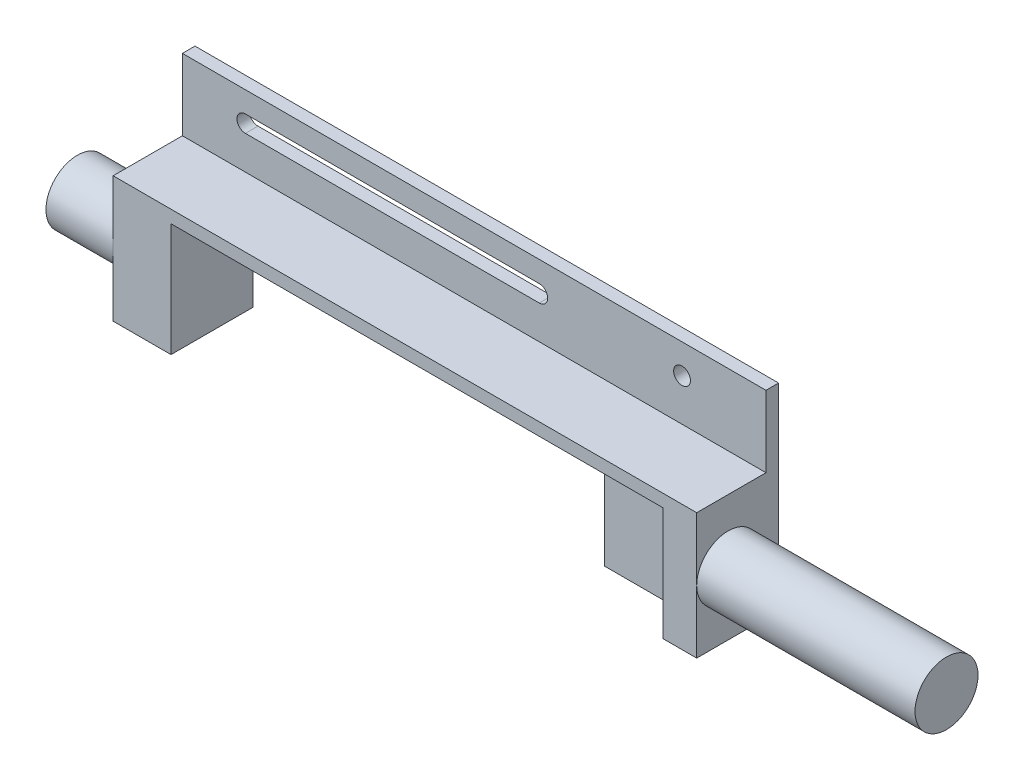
ISO-10303-21;
HEADER;
FILE_DESCRIPTION(('STEP AP214'),'2;1');
FILE_NAME('part.step','',(''),(''),'','','');
FILE_SCHEMA(('AUTOMOTIVE_DESIGN { 1 0 10303 214 1 1 1 1 }'));
ENDSEC;
DATA;
#1=APPLICATION_CONTEXT('core data for automotive mechanical design processes');
#2=APPLICATION_PROTOCOL_DEFINITION('international standard','automotive_design',2000,#1);
#3=PRODUCT_CONTEXT('',#1,'mechanical');
#4=PRODUCT('Part','Part','',(#3));
#5=PRODUCT_RELATED_PRODUCT_CATEGORY('part','',(#4));
#6=PRODUCT_DEFINITION_FORMATION('','',#4);
#7=PRODUCT_DEFINITION_CONTEXT('part definition',#1,'design');
#8=PRODUCT_DEFINITION('design','',#6,#7);
#9=PRODUCT_DEFINITION_SHAPE('','',#8);
#10=(LENGTH_UNIT() NAMED_UNIT(*) SI_UNIT(.MILLI.,.METRE.));
#11=(NAMED_UNIT(*) PLANE_ANGLE_UNIT() SI_UNIT($,.RADIAN.));
#12=(NAMED_UNIT(*) SI_UNIT($,.STERADIAN.) SOLID_ANGLE_UNIT());
#13=UNCERTAINTY_MEASURE_WITH_UNIT(LENGTH_MEASURE(1.E-05),#10,'distance_accuracy_value','');
#14=(GEOMETRIC_REPRESENTATION_CONTEXT(3) GLOBAL_UNCERTAINTY_ASSIGNED_CONTEXT((#13)) GLOBAL_UNIT_ASSIGNED_CONTEXT((#10,
#11,#12)) REPRESENTATION_CONTEXT('',''));
#15=CARTESIAN_POINT('',(0.,0.,0.));
#16=DIRECTION('',(0.,0.,1.));
#17=DIRECTION('',(1.,0.,0.));
#18=AXIS2_PLACEMENT_3D('',#15,#16,#17);
#19=CARTESIAN_POINT('',(109.,0.,-23.45));
#20=DIRECTION('',(1.,0.,0.));
#21=DIRECTION('',(0.,0.,-1.));
#22=AXIS2_PLACEMENT_3D('',#19,#20,#21);
#23=PLANE('',#22);
#24=DIRECTION('',(0.,-1.,0.));
#25=VECTOR('',#24,1.);
#26=CARTESIAN_POINT('',(109.,0.,1.74999999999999));
#27=LINE('',#26,#25);
#28=CARTESIAN_POINT('',(109.,27.,1.74999999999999));
#29=VERTEX_POINT('',#28);
#30=CARTESIAN_POINT('',(109.,0.,1.74999999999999));
#31=VERTEX_POINT('',#30);
#32=EDGE_CURVE('E190',#29,#31,#27,.T.);
#33=ORIENTED_EDGE('',*,*,#32,.F.);
#34=DIRECTION('',(0.,0.,-1.));
#35=VECTOR('',#34,1.);
#36=CARTESIAN_POINT('',(109.,27.,9.75));
#37=LINE('',#36,#35);
#38=CARTESIAN_POINT('',(109.,27.,-9.75));
#39=VERTEX_POINT('',#38);
#40=EDGE_CURVE('E186',#29,#39,#37,.T.);
#41=ORIENTED_EDGE('',*,*,#40,.T.);
#42=DIRECTION('',(0.,-1.,0.));
#43=VECTOR('',#42,1.);
#44=CARTESIAN_POINT('',(109.,0.,-9.75));
#45=LINE('',#44,#43);
#46=CARTESIAN_POINT('',(109.,0.,-9.75));
#47=VERTEX_POINT('',#46);
#48=EDGE_CURVE('E233',#39,#47,#45,.T.);
#49=ORIENTED_EDGE('',*,*,#48,.T.);
#50=DIRECTION('',(0.,0.,-1.));
#51=VECTOR('',#50,1.);
#52=CARTESIAN_POINT('',(109.,0.,9.75));
#53=LINE('',#52,#51);
#54=EDGE_CURVE('E242',#31,#47,#53,.T.);
#55=ORIENTED_EDGE('',*,*,#54,.F.);
#56=EDGE_LOOP('',(#33,#41,#49,#55));
#57=FACE_BOUND('',#56,.T.);
#58=ADVANCED_FACE('F46',(#57),#23,.F.);
#59=CARTESIAN_POINT('',(126.,17.,9.751));
#60=DIRECTION('',(0.,0.,-1.));
#61=DIRECTION('',(-1.,0.,0.));
#62=AXIS2_PLACEMENT_3D('',#59,#60,#61);
#63=CYLINDRICAL_SURFACE('',#62,2.50000000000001);
#64=CARTESIAN_POINT('',(126.,17.,-9.75));
#65=DIRECTION('',(0.,0.,-1.));
#66=DIRECTION('',(-1.,0.,0.));
#67=AXIS2_PLACEMENT_3D('',#64,#65,#66);
#68=CIRCLE('',#67,2.50000000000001);
#69=CARTESIAN_POINT('',(123.5,17.,-9.75));
#70=VERTEX_POINT('',#69);
#71=EDGE_CURVE('E211',#70,#70,#68,.T.);
#72=ORIENTED_EDGE('',*,*,#71,.T.);
#73=EDGE_LOOP('',(#72));
#74=FACE_BOUND('',#73,.T.);
#75=CARTESIAN_POINT('',(126.,17.,1.74999999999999));
#76=DIRECTION('',(0.,0.,1.));
#77=DIRECTION('',(1.,0.,0.));
#78=AXIS2_PLACEMENT_3D('',#75,#76,#77);
#79=CIRCLE('',#78,2.50000000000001);
#80=CARTESIAN_POINT('',(128.5,17.,1.74999999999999));
#81=VERTEX_POINT('',#80);
#82=EDGE_CURVE('E207',#81,#81,#79,.F.);
#83=ORIENTED_EDGE('',*,*,#82,.F.);
#84=EDGE_LOOP('',(#83));
#85=FACE_BOUND('',#84,.T.);
#86=ADVANCED_FACE('F398',(#74,#85),#63,.F.);
#87=CARTESIAN_POINT('',(126.,7.,9.751));
#88=DIRECTION('',(0.,0.,-1.));
#89=DIRECTION('',(-1.,0.,0.));
#90=AXIS2_PLACEMENT_3D('',#87,#88,#89);
#91=CYLINDRICAL_SURFACE('',#90,2.5);
#92=CARTESIAN_POINT('',(126.,7.,-9.75));
#93=DIRECTION('',(0.,0.,-1.));
#94=DIRECTION('',(-1.,0.,0.));
#95=AXIS2_PLACEMENT_3D('',#92,#93,#94);
#96=CIRCLE('',#95,2.5);
#97=CARTESIAN_POINT('',(123.5,7.,-9.75));
#98=VERTEX_POINT('',#97);
#99=EDGE_CURVE('E212',#98,#98,#96,.T.);
#100=ORIENTED_EDGE('',*,*,#99,.T.);
#101=EDGE_LOOP('',(#100));
#102=FACE_BOUND('',#101,.T.);
#103=CARTESIAN_POINT('',(126.,7.,1.74999999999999));
#104=DIRECTION('',(0.,0.,1.));
#105=DIRECTION('',(1.,0.,0.));
#106=AXIS2_PLACEMENT_3D('',#103,#104,#105);
#107=CIRCLE('',#106,2.5);
#108=CARTESIAN_POINT('',(128.5,7.,1.74999999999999));
#109=VERTEX_POINT('',#108);
#110=EDGE_CURVE('E50',#109,#109,#107,.F.);
#111=ORIENTED_EDGE('',*,*,#110,.F.);
#112=EDGE_LOOP('',(#111));
#113=FACE_BOUND('',#112,.T.);
#114=ADVANCED_FACE('F405',(#102,#113),#91,.F.);
#115=CARTESIAN_POINT('',(139.,0.,9.74999999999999));
#116=DIRECTION('',(0.,1.,0.));
#117=DIRECTION('',(0.,0.,1.));
#118=AXIS2_PLACEMENT_3D('',#115,#116,#117);
#119=PLANE('',#118);
#120=DIRECTION('',(-1.,0.,0.));
#121=VECTOR('',#120,1.);
#122=CARTESIAN_POINT('',(139.,0.,9.74999999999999));
#123=LINE('',#122,#121);
#124=CARTESIAN_POINT('',(139.,0.,9.74999999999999));
#125=VERTEX_POINT('',#124);
#126=CARTESIAN_POINT('',(131.,0.,9.74999999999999));
#127=VERTEX_POINT('',#126);
#128=EDGE_CURVE('E366',#125,#127,#123,.T.);
#129=ORIENTED_EDGE('',*,*,#128,.T.);
#130=DIRECTION('',(0.,0.,1.));
#131=VECTOR('',#130,1.);
#132=CARTESIAN_POINT('',(131.,0.,1.74999999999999));
#133=LINE('',#132,#131);
#134=CARTESIAN_POINT('',(131.,0.,1.74999999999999));
#135=VERTEX_POINT('',#134);
#136=EDGE_CURVE('E179',#135,#127,#133,.T.);
#137=ORIENTED_EDGE('',*,*,#136,.F.);
#138=DIRECTION('',(1.,0.,0.));
#139=VECTOR('',#138,1.);
#140=CARTESIAN_POINT('',(131.,0.,1.74999999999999));
#141=LINE('',#140,#139);
#142=EDGE_CURVE('E180',#31,#135,#141,.T.);
#143=ORIENTED_EDGE('',*,*,#142,.F.);
#144=ORIENTED_EDGE('',*,*,#54,.T.);
#145=DIRECTION('',(-1.,0.,0.));
#146=VECTOR('',#145,1.);
#147=CARTESIAN_POINT('',(139.,0.,-9.74999999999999));
#148=LINE('',#147,#146);
#149=CARTESIAN_POINT('',(139.,0.,-9.74999999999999));
#150=VERTEX_POINT('',#149);
#151=EDGE_CURVE('E361',#150,#47,#148,.T.);
#152=ORIENTED_EDGE('',*,*,#151,.F.);
#153=DIRECTION('',(0.,0.,-1.));
#154=VECTOR('',#153,1.);
#155=CARTESIAN_POINT('',(139.,0.,9.74999999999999));
#156=LINE('',#155,#154);
#157=EDGE_CURVE('E341',#125,#150,#156,.T.);
#158=ORIENTED_EDGE('',*,*,#157,.F.);
#159=EDGE_LOOP('',(#129,#137,#143,#144,#152,#158));
#160=FACE_BOUND('',#159,.T.);
#161=ADVANCED_FACE('F441',(#160),#119,.F.);
#162=CARTESIAN_POINT('',(139.,51.1347174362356,-9.75));
#163=DIRECTION('',(0.,0.,1.));
#164=DIRECTION('',(1.,0.,0.));
#165=AXIS2_PLACEMENT_3D('',#162,#163,#164);
#166=PLANE('',#165);
#167=ORIENTED_EDGE('',*,*,#99,.F.);
#168=EDGE_LOOP('',(#167));
#169=FACE_BOUND('',#168,.T.);
#170=ORIENTED_EDGE('',*,*,#71,.F.);
#171=EDGE_LOOP('',(#170));
#172=FACE_BOUND('',#171,.T.);
#173=DIRECTION('',(-1.,0.,0.));
#174=VECTOR('',#173,1.);
#175=CARTESIAN_POINT('',(85.,38.,-9.75));
#176=LINE('',#175,#174);
#177=CARTESIAN_POINT('',(85.,38.,-9.75));
#178=VERTEX_POINT('',#177);
#179=CARTESIAN_POINT('',(15.,38.,-9.75));
#180=VERTEX_POINT('',#179);
#181=EDGE_CURVE('E302',#178,#180,#176,.T.);
#182=ORIENTED_EDGE('',*,*,#181,.F.);
#183=CARTESIAN_POINT('',(85.,40.,-9.75));
#184=DIRECTION('',(0.,0.,-1.));
#185=DIRECTION('',(-1.,0.,0.));
#186=AXIS2_PLACEMENT_3D('',#183,#184,#185);
#187=CIRCLE('',#186,1.99999999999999);
#188=CARTESIAN_POINT('',(85.,42.,-9.75));
#189=VERTEX_POINT('',#188);
#190=EDGE_CURVE('E306',#189,#178,#187,.T.);
#191=ORIENTED_EDGE('',*,*,#190,.F.);
#192=DIRECTION('',(1.,0.,0.));
#193=VECTOR('',#192,1.);
#194=CARTESIAN_POINT('',(85.,42.,-9.75));
#195=LINE('',#194,#193);
#196=CARTESIAN_POINT('',(15.,42.,-9.75));
#197=VERTEX_POINT('',#196);
#198=EDGE_CURVE('E286',#197,#189,#195,.T.);
#199=ORIENTED_EDGE('',*,*,#198,.F.);
#200=CARTESIAN_POINT('',(15.,40.,-9.75));
#201=DIRECTION('',(0.,0.,-1.));
#202=DIRECTION('',(-1.,0.,0.));
#203=AXIS2_PLACEMENT_3D('',#200,#201,#202);
#204=CIRCLE('',#203,1.99999999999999);
#205=EDGE_CURVE('E298',#180,#197,#204,.T.);
#206=ORIENTED_EDGE('',*,*,#205,.F.);
#207=EDGE_LOOP('',(#182,#191,#199,#206));
#208=FACE_BOUND('',#207,.T.);
#209=DIRECTION('',(0.,1.,0.));
#210=VECTOR('',#209,1.);
#211=CARTESIAN_POINT('',(0.,51.1347174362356,-9.75));
#212=LINE('',#211,#210);
#213=CARTESIAN_POINT('',(0.,0.,-9.74999999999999));
#214=VERTEX_POINT('',#213);
#215=CARTESIAN_POINT('',(0.,47.,-9.75));
#216=VERTEX_POINT('',#215);
#217=EDGE_CURVE('E329',#214,#216,#212,.T.);
#218=ORIENTED_EDGE('',*,*,#217,.T.);
#219=DIRECTION('',(-1.,0.,0.));
#220=VECTOR('',#219,1.);
#221=CARTESIAN_POINT('',(139.,47.,-9.75));
#222=LINE('',#221,#220);
#223=CARTESIAN_POINT('',(139.,47.,-9.75));
#224=VERTEX_POINT('',#223);
#225=EDGE_CURVE('E63',#224,#216,#222,.T.);
#226=ORIENTED_EDGE('',*,*,#225,.F.);
#227=DIRECTION('',(0.,-1.,0.));
#228=VECTOR('',#227,1.);
#229=CARTESIAN_POINT('',(139.,51.830145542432,-9.74999999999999));
#230=LINE('',#229,#228);
#231=EDGE_CURVE('E254',#224,#150,#230,.T.);
#232=ORIENTED_EDGE('',*,*,#231,.T.);
#233=ORIENTED_EDGE('',*,*,#151,.T.);
#234=ORIENTED_EDGE('',*,*,#48,.F.);
#235=DIRECTION('',(1.,0.,0.));
#236=VECTOR('',#235,1.);
#237=CARTESIAN_POINT('',(109.,27.,-9.75));
#238=LINE('',#237,#236);
#239=CARTESIAN_POINT('',(13.792995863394,27.,-9.75));
#240=VERTEX_POINT('',#239);
#241=EDGE_CURVE('E239',#240,#39,#238,.T.);
#242=ORIENTED_EDGE('',*,*,#241,.F.);
#243=DIRECTION('',(0.,1.,0.));
#244=VECTOR('',#243,1.);
#245=CARTESIAN_POINT('',(13.792995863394,0.,-9.75));
#246=LINE('',#245,#244);
#247=CARTESIAN_POINT('',(13.792995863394,0.,-9.75));
#248=VERTEX_POINT('',#247);
#249=EDGE_CURVE('E246',#248,#240,#246,.T.);
#250=ORIENTED_EDGE('',*,*,#249,.F.);
#251=EDGE_CURVE('E345',#248,#214,#148,.T.);
#252=ORIENTED_EDGE('',*,*,#251,.T.);
#253=EDGE_LOOP('',(#218,#226,#232,#233,#234,#242,#250,#252));
#254=FACE_BOUND('',#253,.T.);
#255=CARTESIAN_POINT('',(119.,40.,-9.75));
#256=DIRECTION('',(0.,0.,-1.));
#257=DIRECTION('',(-1.,0.,0.));
#258=AXIS2_PLACEMENT_3D('',#255,#256,#257);
#259=CIRCLE('',#258,2.);
#260=CARTESIAN_POINT('',(117.,40.,-9.75));
#261=VERTEX_POINT('',#260);
#262=EDGE_CURVE('E228',#261,#261,#259,.T.);
#263=ORIENTED_EDGE('',*,*,#262,.F.);
#264=EDGE_LOOP('',(#263));
#265=FACE_BOUND('',#264,.T.);
#266=ADVANCED_FACE('F48',(#169,#172,#208,#254,#265),#166,.F.);
#267=CARTESIAN_POINT('',(139.,30.,-6.75));
#268=DIRECTION('',(0.,0.,-1.));
#269=DIRECTION('',(-1.,0.,0.));
#270=AXIS2_PLACEMENT_3D('',#267,#268,#269);
#271=PLANE('',#270);
#272=CARTESIAN_POINT('',(119.,40.,-6.75));
#273=DIRECTION('',(0.,0.,-1.));
#274=DIRECTION('',(-1.,0.,0.));
#275=AXIS2_PLACEMENT_3D('',#272,#273,#274);
#276=CIRCLE('',#275,2.);
#277=CARTESIAN_POINT('',(117.,40.,-6.75));
#278=VERTEX_POINT('',#277);
#279=EDGE_CURVE('E325',#278,#278,#276,.T.);
#280=ORIENTED_EDGE('',*,*,#279,.T.);
#281=EDGE_LOOP('',(#280));
#282=FACE_BOUND('',#281,.T.);
#283=DIRECTION('',(1.,0.,0.));
#284=VECTOR('',#283,1.);
#285=CARTESIAN_POINT('',(139.,42.,-6.75));
#286=LINE('',#285,#284);
#287=CARTESIAN_POINT('',(15.,42.,-6.75));
#288=VERTEX_POINT('',#287);
#289=CARTESIAN_POINT('',(85.,42.,-6.75));
#290=VERTEX_POINT('',#289);
#291=EDGE_CURVE('E317',#288,#290,#286,.T.);
#292=ORIENTED_EDGE('',*,*,#291,.T.);
#293=CARTESIAN_POINT('',(85.,40.,-6.75));
#294=DIRECTION('',(0.,0.,-1.));
#295=DIRECTION('',(-1.,0.,0.));
#296=AXIS2_PLACEMENT_3D('',#293,#294,#295);
#297=CIRCLE('',#296,1.99999999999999);
#298=CARTESIAN_POINT('',(85.,38.,-6.75));
#299=VERTEX_POINT('',#298);
#300=EDGE_CURVE('E321',#290,#299,#297,.T.);
#301=ORIENTED_EDGE('',*,*,#300,.T.);
#302=DIRECTION('',(-1.,0.,0.));
#303=VECTOR('',#302,1.);
#304=CARTESIAN_POINT('',(139.,38.,-6.75));
#305=LINE('',#304,#303);
#306=CARTESIAN_POINT('',(15.,38.,-6.75));
#307=VERTEX_POINT('',#306);
#308=EDGE_CURVE('E309',#299,#307,#305,.T.);
#309=ORIENTED_EDGE('',*,*,#308,.T.);
#310=CARTESIAN_POINT('',(15.,40.,-6.75));
#311=DIRECTION('',(0.,0.,-1.));
#312=DIRECTION('',(-1.,0.,0.));
#313=AXIS2_PLACEMENT_3D('',#310,#311,#312);
#314=CIRCLE('',#313,1.99999999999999);
#315=EDGE_CURVE('E313',#307,#288,#314,.T.);
#316=ORIENTED_EDGE('',*,*,#315,.T.);
#317=EDGE_LOOP('',(#292,#301,#309,#316));
#318=FACE_BOUND('',#317,.T.);
#319=DIRECTION('',(0.,-1.,0.));
#320=VECTOR('',#319,1.);
#321=CARTESIAN_POINT('',(139.,30.,-6.75));
#322=LINE('',#321,#320);
#323=CARTESIAN_POINT('',(139.,47.,-6.75));
#324=VERTEX_POINT('',#323);
#325=CARTESIAN_POINT('',(139.,30.,-6.75));
#326=VERTEX_POINT('',#325);
#327=EDGE_CURVE('E330',#324,#326,#322,.T.);
#328=ORIENTED_EDGE('',*,*,#327,.F.);
#329=DIRECTION('',(-1.,0.,0.));
#330=VECTOR('',#329,1.);
#331=CARTESIAN_POINT('',(139.,47.,-6.75));
#332=LINE('',#331,#330);
#333=CARTESIAN_POINT('',(0.,47.,-6.75));
#334=VERTEX_POINT('',#333);
#335=EDGE_CURVE('E224',#324,#334,#332,.T.);
#336=ORIENTED_EDGE('',*,*,#335,.T.);
#337=DIRECTION('',(0.,-1.,0.));
#338=VECTOR('',#337,1.);
#339=CARTESIAN_POINT('',(0.,30.,-6.75));
#340=LINE('',#339,#338);
#341=CARTESIAN_POINT('',(0.,30.,-6.75));
#342=VERTEX_POINT('',#341);
#343=EDGE_CURVE('E349',#334,#342,#340,.T.);
#344=ORIENTED_EDGE('',*,*,#343,.T.);
#345=DIRECTION('',(-1.,0.,0.));
#346=VECTOR('',#345,1.);
#347=CARTESIAN_POINT('',(139.,30.,-6.75));
#348=LINE('',#347,#346);
#349=EDGE_CURVE('E56',#326,#342,#348,.T.);
#350=ORIENTED_EDGE('',*,*,#349,.F.);
#351=EDGE_LOOP('',(#328,#336,#344,#350));
#352=FACE_BOUND('',#351,.T.);
#353=ADVANCED_FACE('F446',(#282,#318,#352),#271,.F.);
#354=CARTESIAN_POINT('',(139.,30.,6.75));
#355=DIRECTION('',(0.,-1.,0.));
#356=DIRECTION('',(0.,0.,-1.));
#357=AXIS2_PLACEMENT_3D('',#354,#355,#356);
#358=PLANE('',#357);
#359=DIRECTION('',(0.,0.,1.));
#360=VECTOR('',#359,1.);
#361=CARTESIAN_POINT('',(0.,30.,6.75));
#362=LINE('',#361,#360);
#363=CARTESIAN_POINT('',(0.,30.,9.74999999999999));
#364=VERTEX_POINT('',#363);
#365=EDGE_CURVE('E352',#342,#364,#362,.T.);
#366=ORIENTED_EDGE('',*,*,#365,.T.);
#367=DIRECTION('',(1.,0.,0.));
#368=VECTOR('',#367,1.);
#369=CARTESIAN_POINT('',(0.,30.,9.74999999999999));
#370=LINE('',#369,#368);
#371=CARTESIAN_POINT('',(139.,30.,9.74999999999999));
#372=VERTEX_POINT('',#371);
#373=EDGE_CURVE('E229',#364,#372,#370,.T.);
#374=ORIENTED_EDGE('',*,*,#373,.T.);
#375=DIRECTION('',(0.,0.,1.));
#376=VECTOR('',#375,1.);
#377=CARTESIAN_POINT('',(139.,30.,6.75));
#378=LINE('',#377,#376);
#379=EDGE_CURVE('E333',#326,#372,#378,.T.);
#380=ORIENTED_EDGE('',*,*,#379,.F.);
#381=ORIENTED_EDGE('',*,*,#349,.T.);
#382=EDGE_LOOP('',(#366,#374,#380,#381));
#383=FACE_BOUND('',#382,.T.);
#384=ADVANCED_FACE('F444',(#383),#358,.F.);
#385=CARTESIAN_POINT('',(139.,60.,9.75));
#386=DIRECTION('',(0.,0.,-1.));
#387=DIRECTION('',(0.,1.,0.));
#388=AXIS2_PLACEMENT_3D('',#385,#386,#387);
#389=PLANE('',#388);
#390=DIRECTION('',(1.,0.,0.));
#391=VECTOR('',#390,1.);
#392=CARTESIAN_POINT('',(109.,27.,9.75));
#393=LINE('',#392,#391);
#394=CARTESIAN_POINT('',(13.792995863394,27.,9.75));
#395=VERTEX_POINT('',#394);
#396=CARTESIAN_POINT('',(131.,27.,9.74999999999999));
#397=VERTEX_POINT('',#396);
#398=EDGE_CURVE('E238',#395,#397,#393,.T.);
#399=ORIENTED_EDGE('',*,*,#398,.T.);
#400=DIRECTION('',(0.,1.,0.));
#401=VECTOR('',#400,1.);
#402=CARTESIAN_POINT('',(131.,0.,9.74999999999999));
#403=LINE('',#402,#401);
#404=EDGE_CURVE('E175',#127,#397,#403,.T.);
#405=ORIENTED_EDGE('',*,*,#404,.F.);
#406=ORIENTED_EDGE('',*,*,#128,.F.);
#407=DIRECTION('',(0.,-1.,0.));
#408=VECTOR('',#407,1.);
#409=CARTESIAN_POINT('',(139.,60.,9.75));
#410=LINE('',#409,#408);
#411=CARTESIAN_POINT('',(139.,15.,9.75));
#412=VERTEX_POINT('',#411);
#413=EDGE_CURVE('E337',#412,#125,#410,.T.);
#414=ORIENTED_EDGE('',*,*,#413,.F.);
#415=EDGE_CURVE('E338',#372,#412,#410,.T.);
#416=ORIENTED_EDGE('',*,*,#415,.F.);
#417=ORIENTED_EDGE('',*,*,#373,.F.);
#418=DIRECTION('',(0.,-1.,0.));
#419=VECTOR('',#418,1.);
#420=CARTESIAN_POINT('',(0.,60.,9.75));
#421=LINE('',#420,#419);
#422=CARTESIAN_POINT('',(0.,15.,9.74999999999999));
#423=VERTEX_POINT('',#422);
#424=EDGE_CURVE('E70',#364,#423,#421,.T.);
#425=ORIENTED_EDGE('',*,*,#424,.T.);
#426=CARTESIAN_POINT('',(0.,0.,9.74999999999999));
#427=VERTEX_POINT('',#426);
#428=EDGE_CURVE('E355',#423,#427,#421,.T.);
#429=ORIENTED_EDGE('',*,*,#428,.T.);
#430=CARTESIAN_POINT('',(13.792995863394,0.,9.75));
#431=VERTEX_POINT('',#430);
#432=EDGE_CURVE('E365',#431,#427,#123,.T.);
#433=ORIENTED_EDGE('',*,*,#432,.F.);
#434=DIRECTION('',(0.,1.,0.));
#435=VECTOR('',#434,1.);
#436=CARTESIAN_POINT('',(13.792995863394,0.,9.75));
#437=LINE('',#436,#435);
#438=EDGE_CURVE('E234',#431,#395,#437,.T.);
#439=ORIENTED_EDGE('',*,*,#438,.T.);
#440=EDGE_LOOP('',(#399,#405,#406,#414,#416,#417,#425,#429,#433,#439));
#441=FACE_BOUND('',#440,.T.);
#442=ADVANCED_FACE('F439',(#441),#389,.F.);
#443=ORIENTED_EDGE('',*,*,#251,.F.);
#444=DIRECTION('',(0.,0.,-1.));
#445=VECTOR('',#444,1.);
#446=CARTESIAN_POINT('',(13.792995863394,0.,9.75));
#447=LINE('',#446,#445);
#448=EDGE_CURVE('E258',#431,#248,#447,.T.);
#449=ORIENTED_EDGE('',*,*,#448,.F.);
#450=ORIENTED_EDGE('',*,*,#432,.T.);
#451=DIRECTION('',(0.,0.,-1.));
#452=VECTOR('',#451,1.);
#453=CARTESIAN_POINT('',(0.,0.,9.74999999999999));
#454=LINE('',#453,#452);
#455=EDGE_CURVE('E334',#427,#214,#454,.T.);
#456=ORIENTED_EDGE('',*,*,#455,.T.);
#457=EDGE_LOOP('',(#443,#449,#450,#456));
#458=FACE_BOUND('',#457,.T.);
#459=ADVANCED_FACE('F433',(#458),#119,.F.);
#460=CARTESIAN_POINT('',(139.,0.,0.));
#461=DIRECTION('',(1.,0.,0.));
#462=DIRECTION('',(0.,0.,-1.));
#463=AXIS2_PLACEMENT_3D('',#460,#461,#462);
#464=PLANE('',#463);
#465=DIRECTION('',(0.,0.,-1.));
#466=VECTOR('',#465,1.);
#467=CARTESIAN_POINT('',(139.,47.,9.75));
#468=LINE('',#467,#466);
#469=EDGE_CURVE('E221',#324,#224,#468,.T.);
#470=ORIENTED_EDGE('',*,*,#469,.F.);
#471=ORIENTED_EDGE('',*,*,#327,.T.);
#472=ORIENTED_EDGE('',*,*,#379,.T.);
#473=ORIENTED_EDGE('',*,*,#415,.T.);
#474=CARTESIAN_POINT('',(139.,15.,2.25));
#475=DIRECTION('',(1.,0.,0.));
#476=DIRECTION('',(0.,0.,-1.));
#477=AXIS2_PLACEMENT_3D('',#474,#475,#476);
#478=CIRCLE('',#477,7.5);
#479=EDGE_CURVE('E275',#412,#412,#478,.T.);
#480=ORIENTED_EDGE('',*,*,#479,.F.);
#481=ORIENTED_EDGE('',*,*,#413,.T.);
#482=ORIENTED_EDGE('',*,*,#157,.T.);
#483=ORIENTED_EDGE('',*,*,#231,.F.);
#484=EDGE_LOOP('',(#470,#471,#472,#473,#480,#481,#482,#483));
#485=FACE_BOUND('',#484,.T.);
#486=ADVANCED_FACE('F430',(#485),#464,.T.);
#487=CARTESIAN_POINT('',(0.,0.,0.));
#488=DIRECTION('',(1.,0.,0.));
#489=DIRECTION('',(0.,0.,-1.));
#490=AXIS2_PLACEMENT_3D('',#487,#488,#489);
#491=PLANE('',#490);
#492=ORIENTED_EDGE('',*,*,#343,.F.);
#493=DIRECTION('',(0.,0.,-1.));
#494=VECTOR('',#493,1.);
#495=CARTESIAN_POINT('',(0.,47.,0.));
#496=LINE('',#495,#494);
#497=EDGE_CURVE('E11',#334,#216,#496,.T.);
#498=ORIENTED_EDGE('',*,*,#497,.T.);
#499=ORIENTED_EDGE('',*,*,#217,.F.);
#500=ORIENTED_EDGE('',*,*,#455,.F.);
#501=ORIENTED_EDGE('',*,*,#428,.F.);
#502=CARTESIAN_POINT('',(0.,15.,2.25));
#503=DIRECTION('',(1.,0.,0.));
#504=DIRECTION('',(0.,0.,-1.));
#505=AXIS2_PLACEMENT_3D('',#502,#503,#504);
#506=CIRCLE('',#505,7.5);
#507=EDGE_CURVE('E269',#423,#423,#506,.T.);
#508=ORIENTED_EDGE('',*,*,#507,.T.);
#509=ORIENTED_EDGE('',*,*,#424,.F.);
#510=ORIENTED_EDGE('',*,*,#365,.F.);
#511=EDGE_LOOP('',(#492,#498,#499,#500,#501,#508,#509,#510));
#512=FACE_BOUND('',#511,.T.);
#513=ADVANCED_FACE('F378',(#512),#491,.F.);
#514=CARTESIAN_POINT('',(85.,40.,9.75));
#515=DIRECTION('',(0.,0.,-1.));
#516=DIRECTION('',(-1.,0.,0.));
#517=AXIS2_PLACEMENT_3D('',#514,#515,#516);
#518=CYLINDRICAL_SURFACE('',#517,1.99999999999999);
#519=DIRECTION('',(0.,0.,-1.));
#520=VECTOR('',#519,1.);
#521=CARTESIAN_POINT('',(85.,42.,9.75));
#522=LINE('',#521,#520);
#523=EDGE_CURVE('E274',#290,#189,#522,.T.);
#524=ORIENTED_EDGE('',*,*,#523,.T.);
#525=ORIENTED_EDGE('',*,*,#190,.T.);
#526=DIRECTION('',(0.,0.,-1.));
#527=VECTOR('',#526,1.);
#528=CARTESIAN_POINT('',(85.,38.,9.75));
#529=LINE('',#528,#527);
#530=EDGE_CURVE('E282',#299,#178,#529,.T.);
#531=ORIENTED_EDGE('',*,*,#530,.F.);
#532=ORIENTED_EDGE('',*,*,#300,.F.);
#533=EDGE_LOOP('',(#524,#525,#531,#532));
#534=FACE_BOUND('',#533,.T.);
#535=ADVANCED_FACE('F415',(#534),#518,.F.);
#536=CARTESIAN_POINT('',(85.,42.,9.75));
#537=DIRECTION('',(0.,1.,0.));
#538=DIRECTION('',(-1.,0.,0.));
#539=AXIS2_PLACEMENT_3D('',#536,#537,#538);
#540=PLANE('',#539);
#541=DIRECTION('',(0.,0.,-1.));
#542=VECTOR('',#541,1.);
#543=CARTESIAN_POINT('',(15.,42.,9.75));
#544=LINE('',#543,#542);
#545=EDGE_CURVE('E290',#288,#197,#544,.T.);
#546=ORIENTED_EDGE('',*,*,#545,.T.);
#547=ORIENTED_EDGE('',*,*,#198,.T.);
#548=ORIENTED_EDGE('',*,*,#523,.F.);
#549=ORIENTED_EDGE('',*,*,#291,.F.);
#550=EDGE_LOOP('',(#546,#547,#548,#549));
#551=FACE_BOUND('',#550,.T.);
#552=ADVANCED_FACE('F418',(#551),#540,.F.);
#553=CARTESIAN_POINT('',(15.,40.,9.75));
#554=DIRECTION('',(0.,0.,-1.));
#555=DIRECTION('',(-1.,0.,0.));
#556=AXIS2_PLACEMENT_3D('',#553,#554,#555);
#557=CYLINDRICAL_SURFACE('',#556,1.99999999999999);
#558=DIRECTION('',(0.,0.,-1.));
#559=VECTOR('',#558,1.);
#560=CARTESIAN_POINT('',(15.,38.,9.75));
#561=LINE('',#560,#559);
#562=EDGE_CURVE('E287',#307,#180,#561,.T.);
#563=ORIENTED_EDGE('',*,*,#562,.T.);
#564=ORIENTED_EDGE('',*,*,#205,.T.);
#565=ORIENTED_EDGE('',*,*,#545,.F.);
#566=ORIENTED_EDGE('',*,*,#315,.F.);
#567=EDGE_LOOP('',(#563,#564,#565,#566));
#568=FACE_BOUND('',#567,.T.);
#569=ADVANCED_FACE('F422',(#568),#557,.F.);
#570=CARTESIAN_POINT('',(85.,38.,9.75));
#571=DIRECTION('',(0.,-1.,0.));
#572=DIRECTION('',(0.,0.,-1.));
#573=AXIS2_PLACEMENT_3D('',#570,#571,#572);
#574=PLANE('',#573);
#575=ORIENTED_EDGE('',*,*,#530,.T.);
#576=ORIENTED_EDGE('',*,*,#181,.T.);
#577=ORIENTED_EDGE('',*,*,#562,.F.);
#578=ORIENTED_EDGE('',*,*,#308,.F.);
#579=EDGE_LOOP('',(#575,#576,#577,#578));
#580=FACE_BOUND('',#579,.T.);
#581=ADVANCED_FACE('F413',(#580),#574,.F.);
#582=CARTESIAN_POINT('',(119.,40.,9.75));
#583=DIRECTION('',(0.,0.,-1.));
#584=DIRECTION('',(-1.,0.,0.));
#585=AXIS2_PLACEMENT_3D('',#582,#583,#584);
#586=CYLINDRICAL_SURFACE('',#585,2.);
#587=ORIENTED_EDGE('',*,*,#262,.T.);
#588=EDGE_LOOP('',(#587));
#589=FACE_BOUND('',#588,.T.);
#590=ORIENTED_EDGE('',*,*,#279,.F.);
#591=EDGE_LOOP('',(#590));
#592=FACE_BOUND('',#591,.T.);
#593=ADVANCED_FACE('F410',(#589,#592),#586,.F.);
#594=CARTESIAN_POINT('',(191.,15.,2.25));
#595=DIRECTION('',(-1.,0.,0.));
#596=DIRECTION('',(0.,0.,1.));
#597=AXIS2_PLACEMENT_3D('',#594,#595,#596);
#598=CYLINDRICAL_SURFACE('',#597,7.5);
#599=CARTESIAN_POINT('',(191.,15.,2.25));
#600=DIRECTION('',(1.,0.,0.));
#601=DIRECTION('',(0.,0.,-1.));
#602=AXIS2_PLACEMENT_3D('',#599,#600,#601);
#603=CIRCLE('',#602,7.5);
#604=CARTESIAN_POINT('',(191.,15.,-5.25));
#605=VERTEX_POINT('',#604);
#606=EDGE_CURVE('E270',#605,#605,#603,.T.);
#607=ORIENTED_EDGE('',*,*,#606,.F.);
#608=EDGE_LOOP('',(#607));
#609=FACE_BOUND('',#608,.T.);
#610=ORIENTED_EDGE('',*,*,#479,.T.);
#611=EDGE_LOOP('',(#610));
#612=FACE_BOUND('',#611,.T.);
#613=ADVANCED_FACE('F394',(#609,#612),#598,.T.);
#614=CARTESIAN_POINT('',(191.,15.,2.25));
#615=DIRECTION('',(1.,0.,0.));
#616=DIRECTION('',(0.,0.,-1.));
#617=AXIS2_PLACEMENT_3D('',#614,#615,#616);
#618=PLANE('',#617);
#619=ORIENTED_EDGE('',*,*,#606,.T.);
#620=EDGE_LOOP('',(#619));
#621=FACE_BOUND('',#620,.T.);
#622=ADVANCED_FACE('F385',(#621),#618,.T.);
#623=CARTESIAN_POINT('',(-16.,15.,2.25));
#624=DIRECTION('',(1.,0.,0.));
#625=DIRECTION('',(0.,0.,-1.));
#626=AXIS2_PLACEMENT_3D('',#623,#624,#625);
#627=CYLINDRICAL_SURFACE('',#626,7.5);
#628=CARTESIAN_POINT('',(-16.,15.,2.25));
#629=DIRECTION('',(1.,0.,0.));
#630=DIRECTION('',(0.,0.,-1.));
#631=AXIS2_PLACEMENT_3D('',#628,#629,#630);
#632=CIRCLE('',#631,7.5);
#633=CARTESIAN_POINT('',(-16.,15.,-5.25));
#634=VERTEX_POINT('',#633);
#635=EDGE_CURVE('E265',#634,#634,#632,.T.);
#636=ORIENTED_EDGE('',*,*,#635,.T.);
#637=EDGE_LOOP('',(#636));
#638=FACE_BOUND('',#637,.T.);
#639=ORIENTED_EDGE('',*,*,#507,.F.);
#640=EDGE_LOOP('',(#639));
#641=FACE_BOUND('',#640,.T.);
#642=ADVANCED_FACE('F382',(#638,#641),#627,.T.);
#643=CARTESIAN_POINT('',(-16.,15.,2.25));
#644=DIRECTION('',(1.,0.,0.));
#645=DIRECTION('',(0.,0.,-1.));
#646=AXIS2_PLACEMENT_3D('',#643,#644,#645);
#647=PLANE('',#646);
#648=ORIENTED_EDGE('',*,*,#635,.F.);
#649=EDGE_LOOP('',(#648));
#650=FACE_BOUND('',#649,.T.);
#651=ADVANCED_FACE('F384',(#650),#647,.F.);
#652=CARTESIAN_POINT('',(109.,27.,9.75));
#653=DIRECTION('',(0.,1.,0.));
#654=DIRECTION('',(0.,0.,1.));
#655=AXIS2_PLACEMENT_3D('',#652,#653,#654);
#656=PLANE('',#655);
#657=ORIENTED_EDGE('',*,*,#241,.T.);
#658=ORIENTED_EDGE('',*,*,#40,.F.);
#659=DIRECTION('',(-1.,0.,0.));
#660=VECTOR('',#659,1.);
#661=CARTESIAN_POINT('',(131.,27.,1.74999999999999));
#662=LINE('',#661,#660);
#663=CARTESIAN_POINT('',(131.,27.,1.74999999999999));
#664=VERTEX_POINT('',#663);
#665=EDGE_CURVE('E183',#664,#29,#662,.T.);
#666=ORIENTED_EDGE('',*,*,#665,.F.);
#667=DIRECTION('',(0.,0.,1.));
#668=VECTOR('',#667,1.);
#669=CARTESIAN_POINT('',(131.,27.,1.74999999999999));
#670=LINE('',#669,#668);
#671=EDGE_CURVE('E168',#664,#397,#670,.T.);
#672=ORIENTED_EDGE('',*,*,#671,.T.);
#673=ORIENTED_EDGE('',*,*,#398,.F.);
#674=DIRECTION('',(0.,0.,-1.));
#675=VECTOR('',#674,1.);
#676=CARTESIAN_POINT('',(13.792995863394,27.,9.75));
#677=LINE('',#676,#675);
#678=EDGE_CURVE('E255',#395,#240,#677,.T.);
#679=ORIENTED_EDGE('',*,*,#678,.T.);
#680=EDGE_LOOP('',(#657,#658,#666,#672,#673,#679));
#681=FACE_BOUND('',#680,.T.);
#682=ADVANCED_FACE('F185',(#681),#656,.F.);
#683=CARTESIAN_POINT('',(13.792995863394,0.,9.75));
#684=DIRECTION('',(-1.,0.,0.));
#685=DIRECTION('',(0.,0.,1.));
#686=AXIS2_PLACEMENT_3D('',#683,#684,#685);
#687=PLANE('',#686);
#688=ORIENTED_EDGE('',*,*,#249,.T.);
#689=ORIENTED_EDGE('',*,*,#678,.F.);
#690=ORIENTED_EDGE('',*,*,#438,.F.);
#691=ORIENTED_EDGE('',*,*,#448,.T.);
#692=EDGE_LOOP('',(#688,#689,#690,#691));
#693=FACE_BOUND('',#692,.T.);
#694=ADVANCED_FACE('F484',(#693),#687,.F.);
#695=CARTESIAN_POINT('',(139.,47.,9.75));
#696=DIRECTION('',(0.,-1.,0.));
#697=DIRECTION('',(0.,0.,-1.));
#698=AXIS2_PLACEMENT_3D('',#695,#696,#697);
#699=PLANE('',#698);
#700=ORIENTED_EDGE('',*,*,#469,.T.);
#701=ORIENTED_EDGE('',*,*,#225,.T.);
#702=ORIENTED_EDGE('',*,*,#497,.F.);
#703=ORIENTED_EDGE('',*,*,#335,.F.);
#704=EDGE_LOOP('',(#700,#701,#702,#703));
#705=FACE_BOUND('',#704,.T.);
#706=ADVANCED_FACE('F461',(#705),#699,.F.);
#707=CARTESIAN_POINT('',(0.,0.,1.74999999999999));
#708=DIRECTION('',(0.,0.,1.));
#709=DIRECTION('',(1.,0.,0.));
#710=AXIS2_PLACEMENT_3D('',#707,#708,#709);
#711=PLANE('',#710);
#712=DIRECTION('',(0.,1.,0.));
#713=VECTOR('',#712,1.);
#714=CARTESIAN_POINT('',(131.,0.,1.74999999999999));
#715=LINE('',#714,#713);
#716=EDGE_CURVE('E172',#135,#664,#715,.T.);
#717=ORIENTED_EDGE('',*,*,#716,.T.);
#718=ORIENTED_EDGE('',*,*,#665,.T.);
#719=ORIENTED_EDGE('',*,*,#32,.T.);
#720=ORIENTED_EDGE('',*,*,#142,.T.);
#721=EDGE_LOOP('',(#717,#718,#719,#720));
#722=FACE_BOUND('',#721,.T.);
#723=ORIENTED_EDGE('',*,*,#110,.T.);
#724=EDGE_LOOP('',(#723));
#725=FACE_BOUND('',#724,.T.);
#726=ORIENTED_EDGE('',*,*,#82,.T.);
#727=EDGE_LOOP('',(#726));
#728=FACE_BOUND('',#727,.T.);
#729=ADVANCED_FACE('F192',(#722,#725,#728),#711,.T.);
#730=CARTESIAN_POINT('',(131.,0.,1.74999999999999));
#731=DIRECTION('',(1.,0.,0.));
#732=DIRECTION('',(0.,0.,-1.));
#733=AXIS2_PLACEMENT_3D('',#730,#731,#732);
#734=PLANE('',#733);
#735=ORIENTED_EDGE('',*,*,#404,.T.);
#736=ORIENTED_EDGE('',*,*,#671,.F.);
#737=ORIENTED_EDGE('',*,*,#716,.F.);
#738=ORIENTED_EDGE('',*,*,#136,.T.);
#739=EDGE_LOOP('',(#735,#736,#737,#738));
#740=FACE_BOUND('',#739,.T.);
#741=ADVANCED_FACE('F170',(#740),#734,.F.);
#742=CLOSED_SHELL('',(#58,#86,#114,#161,#266,#353,#384,#442,#459,#486,#513,#535,#552,#569,#581,
#593,#613,#622,#642,#651,#682,#694,#706,#729,#741));
#743=MANIFOLD_SOLID_BREP('B2',#742);
#744=ADVANCED_BREP_SHAPE_REPRESENTATION('',(#18,#743),#14);
#745=SHAPE_DEFINITION_REPRESENTATION(#9,#744);
ENDSEC;
END-ISO-10303-21;
